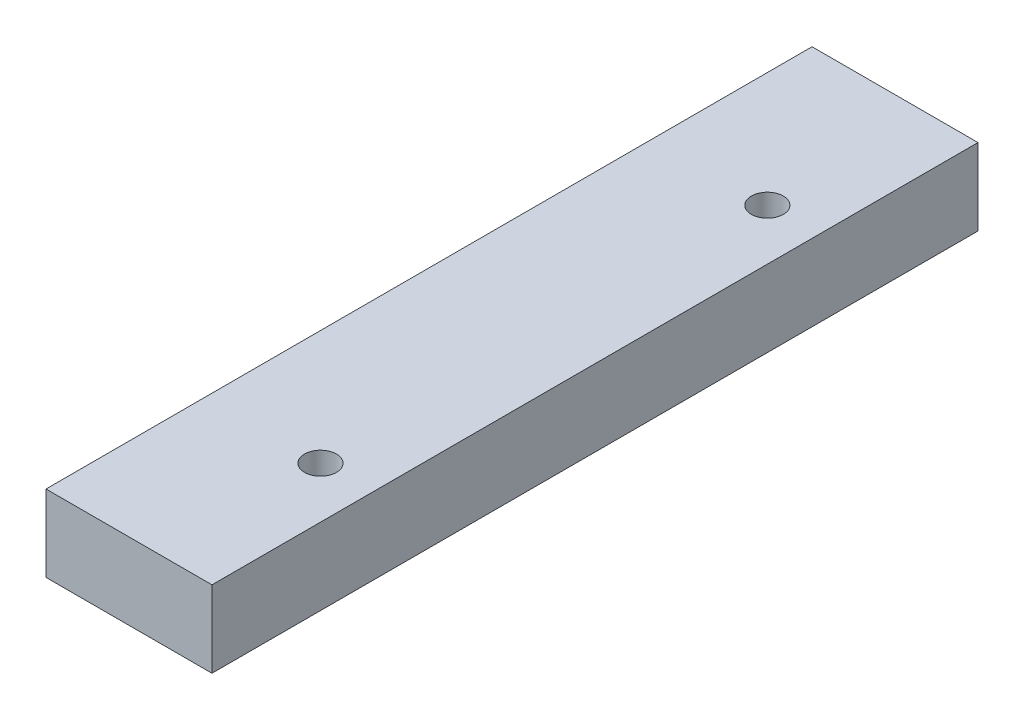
from build123d import *

# Parameters (mm, degrees)
ESQUISSE1_W           = 26
ESQUISSE1_H           = 12
BASE_EXTRUSION_DEPTH  = 60
TROU_TARAUD_M6X1_01_D = 5


with BuildPart() as part:
    # Esquisse1 → Base-Extrusion (new, symmetric)
    with BuildSketch(Plane.XY):
        with Locations((13, 6)):
            Rectangle(ESQUISSE1_W, ESQUISSE1_H)
    extrude(amount=BASE_EXTRUSION_DEPTH, both=True)

    # Trou taraud_ M6x1.01 (through all)
    with Locations(Plane.XZ):
        with Locations((18, -35), (18, 35)):
            Hole(TROU_TARAUD_M6X1_01_D / 2)


solid = part.part
